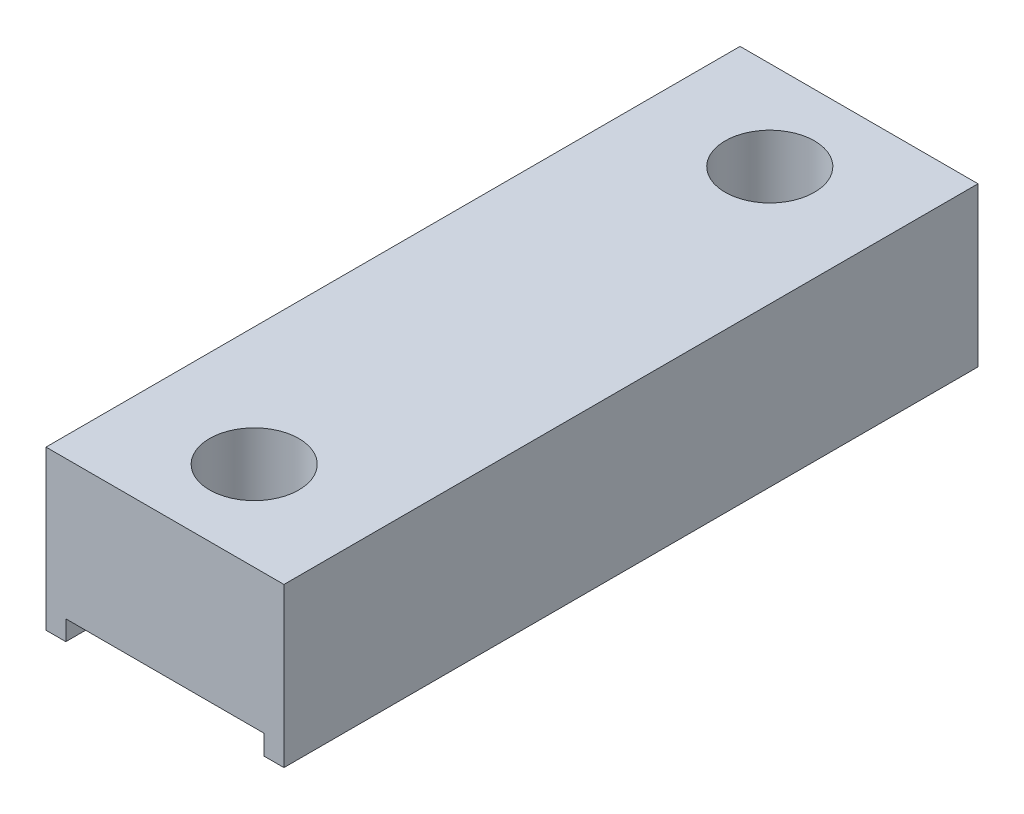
ISO-10303-21;
HEADER;
FILE_DESCRIPTION(('STEP AP214'),'2;1');
FILE_NAME('part.step','',(''),(''),'','','');
FILE_SCHEMA(('AUTOMOTIVE_DESIGN { 1 0 10303 214 1 1 1 1 }'));
ENDSEC;
DATA;
#1=APPLICATION_CONTEXT('core data for automotive mechanical design processes');
#2=APPLICATION_PROTOCOL_DEFINITION('international standard','automotive_design',2000,#1);
#3=PRODUCT_CONTEXT('',#1,'mechanical');
#4=PRODUCT('Part','Part','',(#3));
#5=PRODUCT_RELATED_PRODUCT_CATEGORY('part','',(#4));
#6=PRODUCT_DEFINITION_FORMATION('','',#4);
#7=PRODUCT_DEFINITION_CONTEXT('part definition',#1,'design');
#8=PRODUCT_DEFINITION('design','',#6,#7);
#9=PRODUCT_DEFINITION_SHAPE('','',#8);
#10=(LENGTH_UNIT() NAMED_UNIT(*) SI_UNIT(.MILLI.,.METRE.));
#11=(NAMED_UNIT(*) PLANE_ANGLE_UNIT() SI_UNIT($,.RADIAN.));
#12=(NAMED_UNIT(*) SI_UNIT($,.STERADIAN.) SOLID_ANGLE_UNIT());
#13=UNCERTAINTY_MEASURE_WITH_UNIT(LENGTH_MEASURE(1.E-05),#10,'distance_accuracy_value','');
#14=(GEOMETRIC_REPRESENTATION_CONTEXT(3) GLOBAL_UNCERTAINTY_ASSIGNED_CONTEXT((#13)) GLOBAL_UNIT_ASSIGNED_CONTEXT((#10,
#11,#12)) REPRESENTATION_CONTEXT('',''));
#15=CARTESIAN_POINT('',(0.,0.,0.));
#16=DIRECTION('',(0.,0.,1.));
#17=DIRECTION('',(1.,0.,0.));
#18=AXIS2_PLACEMENT_3D('',#15,#16,#17);
#19=CARTESIAN_POINT('',(-162.278419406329,-9.99999999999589,-70.));
#20=DIRECTION('',(-1.,0.,0.));
#21=DIRECTION('',(0.,0.,1.));
#22=AXIS2_PLACEMENT_3D('',#19,#20,#21);
#23=PLANE('',#22);
#24=DIRECTION('',(0.,-1.,0.));
#25=VECTOR('',#24,1.);
#26=CARTESIAN_POINT('',(-162.278419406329,-9.99999999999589,0.));
#27=LINE('',#26,#25);
#28=CARTESIAN_POINT('',(-162.278419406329,-9.99999999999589,0.));
#29=VERTEX_POINT('',#28);
#30=CARTESIAN_POINT('',(-162.278419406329,-25.9999999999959,0.));
#31=VERTEX_POINT('',#30);
#32=EDGE_CURVE('E113',#29,#31,#27,.T.);
#33=ORIENTED_EDGE('',*,*,#32,.F.);
#34=DIRECTION('',(0.,0.,1.));
#35=VECTOR('',#34,1.);
#36=CARTESIAN_POINT('',(-162.278419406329,-9.99999999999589,-70.));
#37=LINE('',#36,#35);
#38=CARTESIAN_POINT('',(-162.278419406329,-9.99999999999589,-70.));
#39=VERTEX_POINT('',#38);
#40=EDGE_CURVE('E11',#39,#29,#37,.T.);
#41=ORIENTED_EDGE('',*,*,#40,.F.);
#42=DIRECTION('',(0.,-1.,0.));
#43=VECTOR('',#42,1.);
#44=CARTESIAN_POINT('',(-162.278419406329,-9.99999999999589,-70.));
#45=LINE('',#44,#43);
#46=CARTESIAN_POINT('',(-162.278419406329,-25.9999999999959,-70.));
#47=VERTEX_POINT('',#46);
#48=EDGE_CURVE('E134',#39,#47,#45,.T.);
#49=ORIENTED_EDGE('',*,*,#48,.T.);
#50=DIRECTION('',(0.,0.,1.));
#51=VECTOR('',#50,1.);
#52=CARTESIAN_POINT('',(-162.278419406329,-25.9999999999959,-70.));
#53=LINE('',#52,#51);
#54=EDGE_CURVE('E19',#47,#31,#53,.T.);
#55=ORIENTED_EDGE('',*,*,#54,.T.);
#56=EDGE_LOOP('',(#33,#41,#49,#55));
#57=FACE_BOUND('',#56,.T.);
#58=ADVANCED_FACE('F16',(#57),#23,.T.);
#59=CARTESIAN_POINT('',(-162.278419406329,-9.99999999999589,-70.));
#60=DIRECTION('',(0.,1.,0.));
#61=DIRECTION('',(0.,0.,1.));
#62=AXIS2_PLACEMENT_3D('',#59,#60,#61);
#63=PLANE('',#62);
#64=CARTESIAN_POINT('',(-150.278419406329,-9.99999999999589,-9.));
#65=DIRECTION('',(0.,-1.,0.));
#66=DIRECTION('',(0.,0.,-1.));
#67=AXIS2_PLACEMENT_3D('',#64,#65,#66);
#68=CIRCLE('',#67,4.5);
#69=CARTESIAN_POINT('',(-150.278419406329,-9.99999999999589,-13.5));
#70=VERTEX_POINT('',#69);
#71=EDGE_CURVE('E197',#70,#70,#68,.T.);
#72=ORIENTED_EDGE('',*,*,#71,.T.);
#73=EDGE_LOOP('',(#72));
#74=FACE_BOUND('',#73,.T.);
#75=CARTESIAN_POINT('',(-150.278419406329,-9.99999999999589,-61.));
#76=DIRECTION('',(0.,-1.,0.));
#77=DIRECTION('',(0.,0.,-1.));
#78=AXIS2_PLACEMENT_3D('',#75,#76,#77);
#79=CIRCLE('',#78,4.5);
#80=CARTESIAN_POINT('',(-150.278419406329,-9.99999999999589,-65.5));
#81=VERTEX_POINT('',#80);
#82=EDGE_CURVE('E117',#81,#81,#79,.T.);
#83=ORIENTED_EDGE('',*,*,#82,.T.);
#84=EDGE_LOOP('',(#83));
#85=FACE_BOUND('',#84,.T.);
#86=DIRECTION('',(-1.,0.,0.));
#87=VECTOR('',#86,1.);
#88=CARTESIAN_POINT('',(-162.278419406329,-9.99999999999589,0.));
#89=LINE('',#88,#87);
#90=CARTESIAN_POINT('',(-138.278419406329,-9.99999999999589,0.));
#91=VERTEX_POINT('',#90);
#92=EDGE_CURVE('E132',#91,#29,#89,.T.);
#93=ORIENTED_EDGE('',*,*,#92,.F.);
#94=DIRECTION('',(0.,0.,1.));
#95=VECTOR('',#94,1.);
#96=CARTESIAN_POINT('',(-138.278419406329,-9.99999999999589,-70.));
#97=LINE('',#96,#95);
#98=CARTESIAN_POINT('',(-138.278419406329,-9.99999999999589,-70.));
#99=VERTEX_POINT('',#98);
#100=EDGE_CURVE('E25',#99,#91,#97,.T.);
#101=ORIENTED_EDGE('',*,*,#100,.F.);
#102=DIRECTION('',(-1.,0.,0.));
#103=VECTOR('',#102,1.);
#104=CARTESIAN_POINT('',(-162.278419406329,-9.99999999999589,-70.));
#105=LINE('',#104,#103);
#106=EDGE_CURVE('E103',#99,#39,#105,.T.);
#107=ORIENTED_EDGE('',*,*,#106,.T.);
#108=ORIENTED_EDGE('',*,*,#40,.T.);
#109=EDGE_LOOP('',(#93,#101,#107,#108));
#110=FACE_BOUND('',#109,.T.);
#111=ADVANCED_FACE('F146',(#74,#85,#110),#63,.T.);
#112=CARTESIAN_POINT('',(-138.278419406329,-9.99999999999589,-70.));
#113=DIRECTION('',(1.,0.,0.));
#114=DIRECTION('',(0.,0.,-1.));
#115=AXIS2_PLACEMENT_3D('',#112,#113,#114);
#116=PLANE('',#115);
#117=DIRECTION('',(0.,1.,0.));
#118=VECTOR('',#117,1.);
#119=CARTESIAN_POINT('',(-138.278419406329,-9.99999999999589,0.));
#120=LINE('',#119,#118);
#121=CARTESIAN_POINT('',(-138.278419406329,-25.9999999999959,0.));
#122=VERTEX_POINT('',#121);
#123=EDGE_CURVE('E90',#122,#91,#120,.T.);
#124=ORIENTED_EDGE('',*,*,#123,.F.);
#125=DIRECTION('',(0.,0.,1.));
#126=VECTOR('',#125,1.);
#127=CARTESIAN_POINT('',(-138.278419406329,-25.9999999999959,-70.));
#128=LINE('',#127,#126);
#129=CARTESIAN_POINT('',(-138.278419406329,-25.9999999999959,-70.));
#130=VERTEX_POINT('',#129);
#131=EDGE_CURVE('E85',#130,#122,#128,.T.);
#132=ORIENTED_EDGE('',*,*,#131,.F.);
#133=DIRECTION('',(0.,1.,0.));
#134=VECTOR('',#133,1.);
#135=CARTESIAN_POINT('',(-138.278419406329,-9.99999999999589,-70.));
#136=LINE('',#135,#134);
#137=EDGE_CURVE('E88',#130,#99,#136,.T.);
#138=ORIENTED_EDGE('',*,*,#137,.T.);
#139=ORIENTED_EDGE('',*,*,#100,.T.);
#140=EDGE_LOOP('',(#124,#132,#138,#139));
#141=FACE_BOUND('',#140,.T.);
#142=ADVANCED_FACE('F87',(#141),#116,.T.);
#143=CARTESIAN_POINT('',(-140.278419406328,-25.9999999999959,-70.));
#144=DIRECTION('',(0.,-1.,0.));
#145=DIRECTION('',(0.,0.,-1.));
#146=AXIS2_PLACEMENT_3D('',#143,#144,#145);
#147=PLANE('',#146);
#148=DIRECTION('',(1.,0.,0.));
#149=VECTOR('',#148,1.);
#150=CARTESIAN_POINT('',(-140.278419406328,-25.9999999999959,0.));
#151=LINE('',#150,#149);
#152=CARTESIAN_POINT('',(-140.278419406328,-25.9999999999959,0.));
#153=VERTEX_POINT('',#152);
#154=EDGE_CURVE('E129',#153,#122,#151,.T.);
#155=ORIENTED_EDGE('',*,*,#154,.F.);
#156=DIRECTION('',(0.,0.,1.));
#157=VECTOR('',#156,1.);
#158=CARTESIAN_POINT('',(-140.278419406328,-25.9999999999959,-70.));
#159=LINE('',#158,#157);
#160=CARTESIAN_POINT('',(-140.278419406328,-25.9999999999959,-70.));
#161=VERTEX_POINT('',#160);
#162=EDGE_CURVE('E95',#161,#153,#159,.T.);
#163=ORIENTED_EDGE('',*,*,#162,.F.);
#164=DIRECTION('',(1.,0.,0.));
#165=VECTOR('',#164,1.);
#166=CARTESIAN_POINT('',(-140.278419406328,-25.9999999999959,-70.));
#167=LINE('',#166,#165);
#168=EDGE_CURVE('E101',#161,#130,#167,.T.);
#169=ORIENTED_EDGE('',*,*,#168,.T.);
#170=ORIENTED_EDGE('',*,*,#131,.T.);
#171=EDGE_LOOP('',(#155,#163,#169,#170));
#172=FACE_BOUND('',#171,.T.);
#173=ADVANCED_FACE('F105',(#172),#147,.T.);
#174=CARTESIAN_POINT('',(-140.278419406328,-25.9999999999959,-70.));
#175=DIRECTION('',(-1.,-4.44089209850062E-13,0.));
#176=DIRECTION('',(4.44089209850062E-13,-1.,0.));
#177=AXIS2_PLACEMENT_3D('',#174,#175,#176);
#178=PLANE('',#177);
#179=DIRECTION('',(4.44089209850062E-13,-1.,0.));
#180=VECTOR('',#179,1.);
#181=CARTESIAN_POINT('',(-140.278419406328,-25.9999999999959,0.));
#182=LINE('',#181,#180);
#183=CARTESIAN_POINT('',(-140.278419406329,-23.9999999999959,0.));
#184=VERTEX_POINT('',#183);
#185=EDGE_CURVE('E126',#184,#153,#182,.T.);
#186=ORIENTED_EDGE('',*,*,#185,.F.);
#187=DIRECTION('',(0.,0.,1.));
#188=VECTOR('',#187,1.);
#189=CARTESIAN_POINT('',(-140.278419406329,-23.9999999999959,-70.));
#190=LINE('',#189,#188);
#191=CARTESIAN_POINT('',(-140.278419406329,-23.9999999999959,-70.));
#192=VERTEX_POINT('',#191);
#193=EDGE_CURVE('E138',#192,#184,#190,.T.);
#194=ORIENTED_EDGE('',*,*,#193,.F.);
#195=DIRECTION('',(4.44089209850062E-13,-1.,0.));
#196=VECTOR('',#195,1.);
#197=CARTESIAN_POINT('',(-140.278419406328,-25.9999999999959,-70.));
#198=LINE('',#197,#196);
#199=EDGE_CURVE('E106',#192,#161,#198,.T.);
#200=ORIENTED_EDGE('',*,*,#199,.T.);
#201=ORIENTED_EDGE('',*,*,#162,.T.);
#202=EDGE_LOOP('',(#186,#194,#200,#201));
#203=FACE_BOUND('',#202,.T.);
#204=ADVANCED_FACE('F164',(#203),#178,.T.);
#205=CARTESIAN_POINT('',(-140.278419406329,-23.9999999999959,-70.));
#206=DIRECTION('',(0.,-1.,0.));
#207=DIRECTION('',(1.,0.,0.));
#208=AXIS2_PLACEMENT_3D('',#205,#206,#207);
#209=PLANE('',#208);
#210=CARTESIAN_POINT('',(-150.278419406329,-23.9999999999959,-9.));
#211=DIRECTION('',(0.,-1.,0.));
#212=DIRECTION('',(0.,0.,-1.));
#213=AXIS2_PLACEMENT_3D('',#210,#211,#212);
#214=CIRCLE('',#213,4.5);
#215=CARTESIAN_POINT('',(-150.278419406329,-23.9999999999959,-13.5));
#216=VERTEX_POINT('',#215);
#217=EDGE_CURVE('E200',#216,#216,#214,.T.);
#218=ORIENTED_EDGE('',*,*,#217,.F.);
#219=EDGE_LOOP('',(#218));
#220=FACE_BOUND('',#219,.T.);
#221=CARTESIAN_POINT('',(-150.278419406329,-23.9999999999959,-61.));
#222=DIRECTION('',(0.,-1.,0.));
#223=DIRECTION('',(0.,0.,-1.));
#224=AXIS2_PLACEMENT_3D('',#221,#222,#223);
#225=CIRCLE('',#224,4.5);
#226=CARTESIAN_POINT('',(-150.278419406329,-23.9999999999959,-65.5));
#227=VERTEX_POINT('',#226);
#228=EDGE_CURVE('E202',#227,#227,#225,.T.);
#229=ORIENTED_EDGE('',*,*,#228,.F.);
#230=EDGE_LOOP('',(#229));
#231=FACE_BOUND('',#230,.T.);
#232=DIRECTION('',(1.,0.,0.));
#233=VECTOR('',#232,1.);
#234=CARTESIAN_POINT('',(-140.278419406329,-23.9999999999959,0.));
#235=LINE('',#234,#233);
#236=CARTESIAN_POINT('',(-160.278419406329,-23.9999999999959,0.));
#237=VERTEX_POINT('',#236);
#238=EDGE_CURVE('E123',#237,#184,#235,.T.);
#239=ORIENTED_EDGE('',*,*,#238,.F.);
#240=DIRECTION('',(0.,0.,1.));
#241=VECTOR('',#240,1.);
#242=CARTESIAN_POINT('',(-160.278419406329,-23.9999999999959,-70.));
#243=LINE('',#242,#241);
#244=CARTESIAN_POINT('',(-160.278419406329,-23.9999999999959,-70.));
#245=VERTEX_POINT('',#244);
#246=EDGE_CURVE('E140',#245,#237,#243,.T.);
#247=ORIENTED_EDGE('',*,*,#246,.F.);
#248=DIRECTION('',(1.,0.,0.));
#249=VECTOR('',#248,1.);
#250=CARTESIAN_POINT('',(-140.278419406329,-23.9999999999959,-70.));
#251=LINE('',#250,#249);
#252=EDGE_CURVE('E108',#245,#192,#251,.T.);
#253=ORIENTED_EDGE('',*,*,#252,.T.);
#254=ORIENTED_EDGE('',*,*,#193,.T.);
#255=EDGE_LOOP('',(#239,#247,#253,#254));
#256=FACE_BOUND('',#255,.T.);
#257=ADVANCED_FACE('F167',(#220,#231,#256),#209,.T.);
#258=CARTESIAN_POINT('',(-160.278419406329,-25.9999999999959,-70.));
#259=DIRECTION('',(1.,0.,0.));
#260=DIRECTION('',(0.,0.,-1.));
#261=AXIS2_PLACEMENT_3D('',#258,#259,#260);
#262=PLANE('',#261);
#263=DIRECTION('',(0.,1.,0.));
#264=VECTOR('',#263,1.);
#265=CARTESIAN_POINT('',(-160.278419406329,-25.9999999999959,0.));
#266=LINE('',#265,#264);
#267=CARTESIAN_POINT('',(-160.278419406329,-25.9999999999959,0.));
#268=VERTEX_POINT('',#267);
#269=EDGE_CURVE('E120',#268,#237,#266,.T.);
#270=ORIENTED_EDGE('',*,*,#269,.F.);
#271=DIRECTION('',(0.,0.,1.));
#272=VECTOR('',#271,1.);
#273=CARTESIAN_POINT('',(-160.278419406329,-25.9999999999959,-70.));
#274=LINE('',#273,#272);
#275=CARTESIAN_POINT('',(-160.278419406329,-25.9999999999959,-70.));
#276=VERTEX_POINT('',#275);
#277=EDGE_CURVE('E141',#276,#268,#274,.T.);
#278=ORIENTED_EDGE('',*,*,#277,.F.);
#279=DIRECTION('',(0.,1.,0.));
#280=VECTOR('',#279,1.);
#281=CARTESIAN_POINT('',(-160.278419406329,-25.9999999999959,-70.));
#282=LINE('',#281,#280);
#283=EDGE_CURVE('E212',#276,#245,#282,.T.);
#284=ORIENTED_EDGE('',*,*,#283,.T.);
#285=ORIENTED_EDGE('',*,*,#246,.T.);
#286=EDGE_LOOP('',(#270,#278,#284,#285));
#287=FACE_BOUND('',#286,.T.);
#288=ADVANCED_FACE('F171',(#287),#262,.T.);
#289=CARTESIAN_POINT('',(-162.278419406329,-25.9999999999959,-70.));
#290=DIRECTION('',(0.,-1.,0.));
#291=DIRECTION('',(1.,0.,0.));
#292=AXIS2_PLACEMENT_3D('',#289,#290,#291);
#293=PLANE('',#292);
#294=DIRECTION('',(1.,0.,0.));
#295=VECTOR('',#294,1.);
#296=CARTESIAN_POINT('',(-162.278419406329,-25.9999999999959,0.));
#297=LINE('',#296,#295);
#298=EDGE_CURVE('E116',#31,#268,#297,.T.);
#299=ORIENTED_EDGE('',*,*,#298,.F.);
#300=ORIENTED_EDGE('',*,*,#54,.F.);
#301=DIRECTION('',(1.,0.,0.));
#302=VECTOR('',#301,1.);
#303=CARTESIAN_POINT('',(-162.278419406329,-25.9999999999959,-70.));
#304=LINE('',#303,#302);
#305=EDGE_CURVE('E210',#47,#276,#304,.T.);
#306=ORIENTED_EDGE('',*,*,#305,.T.);
#307=ORIENTED_EDGE('',*,*,#277,.T.);
#308=EDGE_LOOP('',(#299,#300,#306,#307));
#309=FACE_BOUND('',#308,.T.);
#310=ADVANCED_FACE('F143',(#309),#293,.T.);
#311=CARTESIAN_POINT('',(0.,0.,-70.));
#312=DIRECTION('',(0.,0.,1.));
#313=DIRECTION('',(1.,0.,0.));
#314=AXIS2_PLACEMENT_3D('',#311,#312,#313);
#315=PLANE('',#314);
#316=ORIENTED_EDGE('',*,*,#48,.F.);
#317=ORIENTED_EDGE('',*,*,#106,.F.);
#318=ORIENTED_EDGE('',*,*,#137,.F.);
#319=ORIENTED_EDGE('',*,*,#168,.F.);
#320=ORIENTED_EDGE('',*,*,#199,.F.);
#321=ORIENTED_EDGE('',*,*,#252,.F.);
#322=ORIENTED_EDGE('',*,*,#283,.F.);
#323=ORIENTED_EDGE('',*,*,#305,.F.);
#324=EDGE_LOOP('',(#316,#317,#318,#319,#320,#321,#322,#323));
#325=FACE_BOUND('',#324,.T.);
#326=ADVANCED_FACE('F99',(#325),#315,.F.);
#327=CARTESIAN_POINT('',(0.,0.,0.));
#328=DIRECTION('',(0.,0.,1.));
#329=DIRECTION('',(1.,0.,0.));
#330=AXIS2_PLACEMENT_3D('',#327,#328,#329);
#331=PLANE('',#330);
#332=ORIENTED_EDGE('',*,*,#32,.T.);
#333=ORIENTED_EDGE('',*,*,#298,.T.);
#334=ORIENTED_EDGE('',*,*,#269,.T.);
#335=ORIENTED_EDGE('',*,*,#238,.T.);
#336=ORIENTED_EDGE('',*,*,#185,.T.);
#337=ORIENTED_EDGE('',*,*,#154,.T.);
#338=ORIENTED_EDGE('',*,*,#123,.T.);
#339=ORIENTED_EDGE('',*,*,#92,.T.);
#340=EDGE_LOOP('',(#332,#333,#334,#335,#336,#337,#338,#339));
#341=FACE_BOUND('',#340,.T.);
#342=ADVANCED_FACE('F145',(#341),#331,.T.);
#343=CARTESIAN_POINT('',(-150.278419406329,-23.9999999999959,-61.));
#344=DIRECTION('',(0.,-1.,0.));
#345=DIRECTION('',(0.,0.,-1.));
#346=AXIS2_PLACEMENT_3D('',#343,#344,#345);
#347=CYLINDRICAL_SURFACE('',#346,4.5);
#348=ORIENTED_EDGE('',*,*,#82,.F.);
#349=EDGE_LOOP('',(#348));
#350=FACE_BOUND('',#349,.T.);
#351=ORIENTED_EDGE('',*,*,#228,.T.);
#352=EDGE_LOOP('',(#351));
#353=FACE_BOUND('',#352,.T.);
#354=ADVANCED_FACE('F184',(#350,#353),#347,.F.);
#355=CARTESIAN_POINT('',(-150.278419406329,-23.9999999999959,-9.));
#356=DIRECTION('',(0.,-1.,0.));
#357=DIRECTION('',(0.,0.,-1.));
#358=AXIS2_PLACEMENT_3D('',#355,#356,#357);
#359=CYLINDRICAL_SURFACE('',#358,4.5);
#360=ORIENTED_EDGE('',*,*,#71,.F.);
#361=EDGE_LOOP('',(#360));
#362=FACE_BOUND('',#361,.T.);
#363=ORIENTED_EDGE('',*,*,#217,.T.);
#364=EDGE_LOOP('',(#363));
#365=FACE_BOUND('',#364,.T.);
#366=ADVANCED_FACE('F188',(#362,#365),#359,.F.);
#367=CLOSED_SHELL('',(#58,#111,#142,#173,#204,#257,#288,#310,#326,#342,#354,#366));
#368=MANIFOLD_SOLID_BREP('B1',#367);
#369=ADVANCED_BREP_SHAPE_REPRESENTATION('',(#18,#368),#14);
#370=SHAPE_DEFINITION_REPRESENTATION(#9,#369);
ENDSEC;
END-ISO-10303-21;
